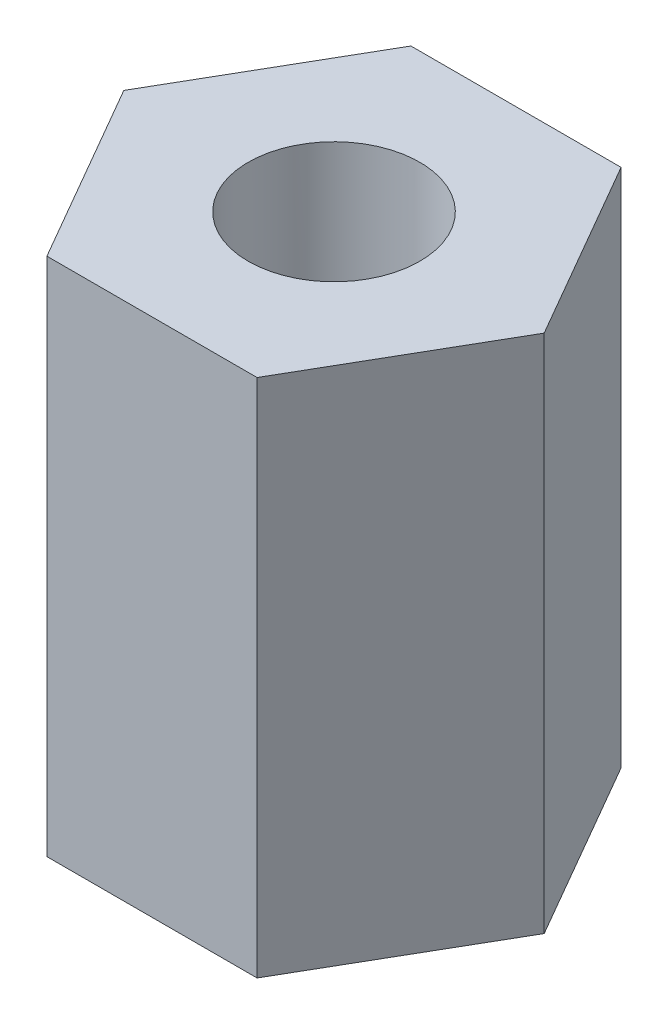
from build123d import *

# Parameters (mm, degrees)
AUFSATZ_LINEAR_AUSTRAGEN1_DEPTH = 10
SKIZZE6_R                       = 1.65
SCHNITT_LINEAR_AUSTRAGEN1_DEPTH = 5
SCHNITT_LINEAR_START            = -10
SKIZZE7_R                       = 1.65
SCHNITT_LINEAR_AUSTRAGEN2_DEPTH = 10


with BuildPart() as part:
    # Skizze1 → Aufsatz-Linear austragen1 (new body)
    with BuildSketch(Plane(origin=(0, 0, 0), x_dir=(1, 0, 0), z_dir=(0, 1, 0))):
        Polygon((2.020725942, 3.5), (-2.020725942, 3.5), (-4.041451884, 0), (-2.020725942, -3.5), (2.020725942, -3.5), (4.041451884, 0), align=None)
    extrude(amount=AUFSATZ_LINEAR_AUSTRAGEN1_DEPTH)

    # Skizze6 → Schnitt-Linear austragen1 (cut)
    with BuildSketch(Plane(origin=(0, 10, 0), x_dir=(1, 0, 0), z_dir=(0, 1, 0))):
        with Locations(Location((0, 0, 0), (0, 0, 270))):
            Circle(SKIZZE6_R)
    extrude(amount=-SCHNITT_LINEAR_AUSTRAGEN1_DEPTH, mode=Mode.SUBTRACT)

    # Skizze7 → Schnitt-Linear austragen2 (cut)
    with BuildSketch(Plane.XZ.offset(SCHNITT_LINEAR_START)):
        with Locations(Location((0, 0, 0), (0, 0, 90))):
            Circle(SKIZZE7_R)
    extrude(amount=SCHNITT_LINEAR_AUSTRAGEN2_DEPTH, mode=Mode.SUBTRACT)


solid = part.part
